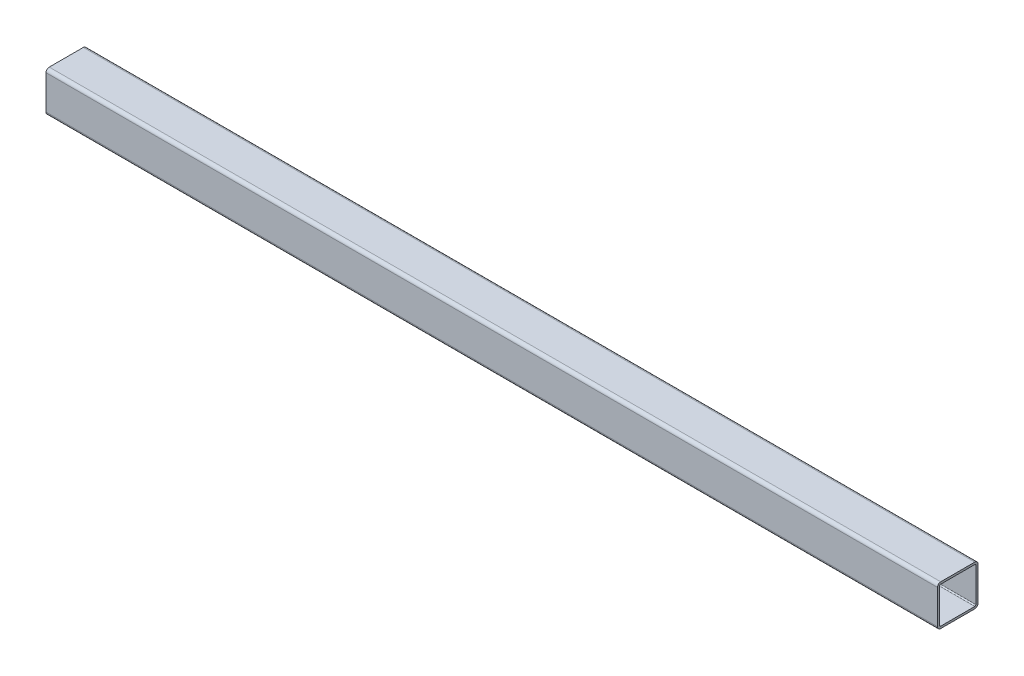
from build123d import *

# Parameters (mm, degrees)
BOSS_EXTRUDE1_DEPTH = 698.5


with BuildPart() as part:
    # Sketch1 → Boss-Extrude1 (new body)
    with BuildSketch(Plane(origin=(0, 0, 0), x_dir=(0, 0, -1), z_dir=(1, 0, 0))):
        with BuildLine():
            Line((0, 2.54), (0, 29.21))
            ThreePointArc((0, 29.21), (-0.743948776, 31.006051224), (-2.54, 31.75))
            Line((-2.54, 31.75), (-29.21, 31.75))
            ThreePointArc((-29.21, 31.75), (-31.006051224, 31.006051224), (-31.75, 29.21))
            Line((-31.75, 29.21), (-31.75, 2.54))
            ThreePointArc((-31.75, 2.54), (-31.006051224, 0.743948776), (-29.21, 0))
            Line((-29.21, 0), (-2.54, 0))
            ThreePointArc((-2.54, 0), (-0.743948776, 0.743948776), (0, 2.54))
        make_face()
        with BuildLine():
            Line((-1.651, 2.54), (-1.651, 29.21))
            ThreePointArc((-1.651, 29.21), (-1.911382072, 29.838617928), (-2.54, 30.099))
            Line((-2.54, 30.099), (-29.21, 30.099))
            ThreePointArc((-29.21, 30.099), (-29.838617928, 29.838617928), (-30.099, 29.21))
            Line((-30.099, 29.21), (-30.099, 2.54))
            ThreePointArc((-30.099, 2.54), (-29.838617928, 1.911382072), (-29.21, 1.651))
            Line((-29.21, 1.651), (-2.54, 1.651))
            ThreePointArc((-2.54, 1.651), (-1.911382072, 1.911382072), (-1.651, 2.54))
        make_face(mode=Mode.SUBTRACT)
    extrude(amount=BOSS_EXTRUDE1_DEPTH)


solid = part.part
